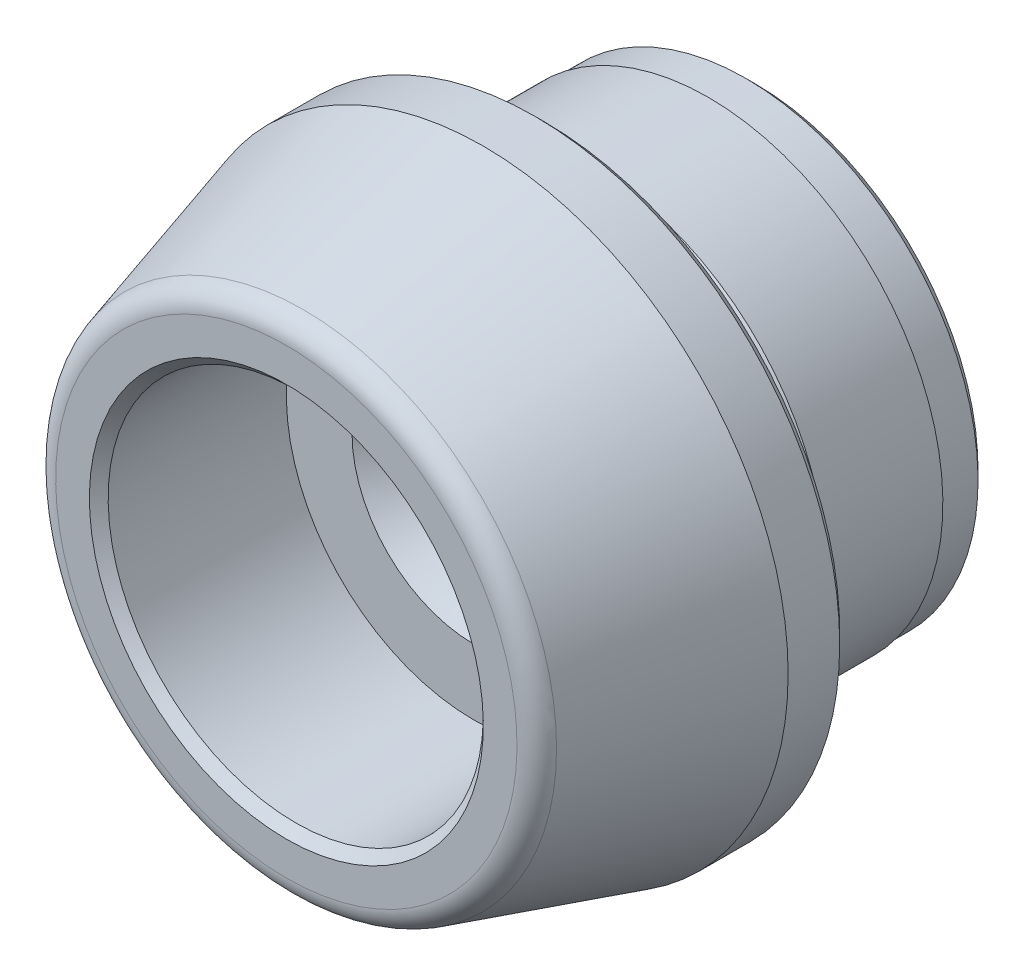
ISO-10303-21;
HEADER;
FILE_DESCRIPTION(('STEP AP214'),'2;1');
FILE_NAME('part.step','',(''),(''),'','','');
FILE_SCHEMA(('AUTOMOTIVE_DESIGN { 1 0 10303 214 1 1 1 1 }'));
ENDSEC;
DATA;
#1=APPLICATION_CONTEXT('core data for automotive mechanical design processes');
#2=APPLICATION_PROTOCOL_DEFINITION('international standard','automotive_design',2000,#1);
#3=PRODUCT_CONTEXT('',#1,'mechanical');
#4=PRODUCT('Part','Part','',(#3));
#5=PRODUCT_RELATED_PRODUCT_CATEGORY('part','',(#4));
#6=PRODUCT_DEFINITION_FORMATION('','',#4);
#7=PRODUCT_DEFINITION_CONTEXT('part definition',#1,'design');
#8=PRODUCT_DEFINITION('design','',#6,#7);
#9=PRODUCT_DEFINITION_SHAPE('','',#8);
#10=(LENGTH_UNIT() NAMED_UNIT(*) SI_UNIT(.MILLI.,.METRE.));
#11=(NAMED_UNIT(*) PLANE_ANGLE_UNIT() SI_UNIT($,.RADIAN.));
#12=(NAMED_UNIT(*) SI_UNIT($,.STERADIAN.) SOLID_ANGLE_UNIT());
#13=UNCERTAINTY_MEASURE_WITH_UNIT(LENGTH_MEASURE(1.E-05),#10,'distance_accuracy_value','');
#14=(GEOMETRIC_REPRESENTATION_CONTEXT(3) GLOBAL_UNCERTAINTY_ASSIGNED_CONTEXT((#13)) GLOBAL_UNIT_ASSIGNED_CONTEXT((#10,
#11,#12)) REPRESENTATION_CONTEXT('',''));
#15=CARTESIAN_POINT('',(0.,0.,0.));
#16=DIRECTION('',(0.,0.,1.));
#17=DIRECTION('',(1.,0.,0.));
#18=AXIS2_PLACEMENT_3D('',#15,#16,#17);
#19=CARTESIAN_POINT('',(0.,0.,10.));
#20=DIRECTION('',(0.,0.,1.));
#21=DIRECTION('',(0.,-1.,0.));
#22=AXIS2_PLACEMENT_3D('',#19,#20,#21);
#23=CYLINDRICAL_SURFACE('',#22,2.1);
#24=CARTESIAN_POINT('',(0.,0.,5.5));
#25=DIRECTION('',(0.,0.,1.));
#26=DIRECTION('',(0.,-1.,0.));
#27=AXIS2_PLACEMENT_3D('',#24,#25,#26);
#28=CIRCLE('',#27,2.1);
#29=CARTESIAN_POINT('',(0.,-2.10000000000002,5.49999999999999));
#30=VERTEX_POINT('',#29);
#31=EDGE_CURVE('E21',#30,#30,#28,.T.);
#32=ORIENTED_EDGE('',*,*,#31,.T.);
#33=EDGE_LOOP('',(#32));
#34=FACE_BOUND('',#33,.T.);
#35=CARTESIAN_POINT('',(0.,0.,0.500000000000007));
#36=DIRECTION('',(0.,0.,-1.));
#37=DIRECTION('',(0.,1.,0.));
#38=AXIS2_PLACEMENT_3D('',#35,#36,#37);
#39=CIRCLE('',#38,2.1);
#40=CARTESIAN_POINT('',(0.,2.1,0.500000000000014));
#41=VERTEX_POINT('',#40);
#42=EDGE_CURVE('E25',#41,#41,#39,.T.);
#43=ORIENTED_EDGE('',*,*,#42,.T.);
#44=EDGE_LOOP('',(#43));
#45=FACE_BOUND('',#44,.T.);
#46=ADVANCED_FACE('F14',(#34,#45),#23,.F.);
#47=CARTESIAN_POINT('',(0.,0.,0.));
#48=DIRECTION('',(0.,0.,-1.));
#49=DIRECTION('',(0.,1.,0.));
#50=AXIS2_PLACEMENT_3D('',#47,#48,#49);
#51=CYLINDRICAL_SURFACE('',#50,5.);
#52=CARTESIAN_POINT('',(0.,0.,3.5));
#53=DIRECTION('',(0.,0.,-1.));
#54=DIRECTION('',(0.,1.,0.));
#55=AXIS2_PLACEMENT_3D('',#52,#53,#54);
#56=CIRCLE('',#55,5.);
#57=CARTESIAN_POINT('',(0.,4.99999999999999,3.50000000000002));
#58=VERTEX_POINT('',#57);
#59=EDGE_CURVE('E76',#58,#58,#56,.T.);
#60=ORIENTED_EDGE('',*,*,#59,.T.);
#61=EDGE_LOOP('',(#60));
#62=FACE_BOUND('',#61,.T.);
#63=CARTESIAN_POINT('',(0.,0.,1.));
#64=DIRECTION('',(0.,0.,-1.));
#65=DIRECTION('',(0.,1.,0.));
#66=AXIS2_PLACEMENT_3D('',#63,#64,#65);
#67=CIRCLE('',#66,5.);
#68=CARTESIAN_POINT('',(0.,5.,1.00000000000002));
#69=VERTEX_POINT('',#68);
#70=EDGE_CURVE('E64',#69,#69,#67,.T.);
#71=ORIENTED_EDGE('',*,*,#70,.F.);
#72=EDGE_LOOP('',(#71));
#73=FACE_BOUND('',#72,.T.);
#74=ADVANCED_FACE('F123',(#62,#73),#51,.T.);
#75=CARTESIAN_POINT('',(0.,0.,0.));
#76=DIRECTION('',(0.,0.,-1.));
#77=DIRECTION('',(0.,1.,0.));
#78=AXIS2_PLACEMENT_3D('',#75,#76,#77);
#79=PLANE('',#78);
#80=CARTESIAN_POINT('',(0.,0.,0.));
#81=DIRECTION('',(0.,0.,-1.));
#82=DIRECTION('',(0.,1.,0.));
#83=AXIS2_PLACEMENT_3D('',#80,#81,#82);
#84=CIRCLE('',#83,2.6);
#85=CARTESIAN_POINT('',(0.,2.6,0.));
#86=VERTEX_POINT('',#85);
#87=EDGE_CURVE('E9',#86,#86,#84,.F.);
#88=ORIENTED_EDGE('',*,*,#87,.T.);
#89=EDGE_LOOP('',(#88));
#90=FACE_BOUND('',#89,.T.);
#91=CARTESIAN_POINT('',(0.,0.,0.));
#92=DIRECTION('',(0.,0.,-1.));
#93=DIRECTION('',(0.,1.,0.));
#94=AXIS2_PLACEMENT_3D('',#91,#92,#93);
#95=CIRCLE('',#94,4.75);
#96=CARTESIAN_POINT('',(0.,4.75,0.));
#97=VERTEX_POINT('',#96);
#98=EDGE_CURVE('E37',#97,#97,#95,.T.);
#99=ORIENTED_EDGE('',*,*,#98,.T.);
#100=EDGE_LOOP('',(#99));
#101=FACE_BOUND('',#100,.T.);
#102=ADVANCED_FACE('F129',(#90,#101),#79,.T.);
#103=CARTESIAN_POINT('',(0.,0.,10.));
#104=DIRECTION('',(0.,0.,1.));
#105=DIRECTION('',(0.,-1.,0.));
#106=AXIS2_PLACEMENT_3D('',#103,#104,#105);
#107=PLANE('',#106);
#108=CARTESIAN_POINT('',(0.,0.,10.));
#109=DIRECTION('',(0.,0.,1.));
#110=DIRECTION('',(0.,-1.,0.));
#111=AXIS2_PLACEMENT_3D('',#108,#109,#110);
#112=CIRCLE('',#111,4.2);
#113=CARTESIAN_POINT('',(0.,-4.20000000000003,9.99999999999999));
#114=VERTEX_POINT('',#113);
#115=EDGE_CURVE('E40',#114,#114,#112,.F.);
#116=ORIENTED_EDGE('',*,*,#115,.T.);
#117=EDGE_LOOP('',(#116));
#118=FACE_BOUND('',#117,.T.);
#119=CARTESIAN_POINT('',(0.,0.,10.));
#120=DIRECTION('',(0.,0.,1.));
#121=DIRECTION('',(0.,-1.,0.));
#122=AXIS2_PLACEMENT_3D('',#119,#120,#121);
#123=CIRCLE('',#122,4.91889235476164);
#124=CARTESIAN_POINT('',(0.,-4.91889235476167,9.99999999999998));
#125=VERTEX_POINT('',#124);
#126=EDGE_CURVE('E52',#125,#125,#123,.T.);
#127=ORIENTED_EDGE('',*,*,#126,.T.);
#128=EDGE_LOOP('',(#127));
#129=FACE_BOUND('',#128,.T.);
#130=ADVANCED_FACE('F137',(#118,#129),#107,.T.);
#131=CARTESIAN_POINT('',(0.,0.,5.8));
#132=DIRECTION('',(0.,0.,-1.));
#133=DIRECTION('',(0.,1.,0.));
#134=AXIS2_PLACEMENT_3D('',#131,#132,#133);
#135=CONICAL_SURFACE('',#134,6.5,0.279252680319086);
#136=CARTESIAN_POINT('',(0.,0.,9.63781867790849));
#137=DIRECTION('',(0.,0.,1.));
#138=DIRECTION('',(0.,-1.,0.));
#139=AXIS2_PLACEMENT_3D('',#136,#137,#138);
#140=CIRCLE('',#139,5.3995232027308);
#141=CARTESIAN_POINT('',(0.,-5.39952320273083,9.63781867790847));
#142=VERTEX_POINT('',#141);
#143=EDGE_CURVE('E55',#142,#142,#140,.F.);
#144=ORIENTED_EDGE('',*,*,#143,.T.);
#145=EDGE_LOOP('',(#144));
#146=FACE_BOUND('',#145,.T.);
#147=CARTESIAN_POINT('',(0.,0.,5.8));
#148=DIRECTION('',(0.,0.,-1.));
#149=DIRECTION('',(0.,1.,0.));
#150=AXIS2_PLACEMENT_3D('',#147,#148,#149);
#151=CIRCLE('',#150,6.5);
#152=CARTESIAN_POINT('',(0.,6.49999999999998,5.80000000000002));
#153=VERTEX_POINT('',#152);
#154=EDGE_CURVE('E58',#153,#153,#151,.T.);
#155=ORIENTED_EDGE('',*,*,#154,.F.);
#156=EDGE_LOOP('',(#155));
#157=FACE_BOUND('',#156,.T.);
#158=ADVANCED_FACE('F141',(#146,#157),#135,.T.);
#159=CARTESIAN_POINT('',(0.,0.,0.));
#160=DIRECTION('',(0.,0.,-1.));
#161=DIRECTION('',(0.,1.,0.));
#162=AXIS2_PLACEMENT_3D('',#159,#160,#161);
#163=CYLINDRICAL_SURFACE('',#162,6.5);
#164=CARTESIAN_POINT('',(0.,0.,4.7));
#165=DIRECTION('',(0.,0.,-1.));
#166=DIRECTION('',(0.,1.,0.));
#167=AXIS2_PLACEMENT_3D('',#164,#165,#166);
#168=CIRCLE('',#167,6.5);
#169=CARTESIAN_POINT('',(0.,6.49999999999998,4.70000000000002));
#170=VERTEX_POINT('',#169);
#171=EDGE_CURVE('E46',#170,#170,#168,.F.);
#172=ORIENTED_EDGE('',*,*,#171,.T.);
#173=EDGE_LOOP('',(#172));
#174=FACE_BOUND('',#173,.T.);
#175=ORIENTED_EDGE('',*,*,#154,.T.);
#176=EDGE_LOOP('',(#175));
#177=FACE_BOUND('',#176,.T.);
#178=ADVANCED_FACE('F100',(#174,#177),#163,.T.);
#179=CARTESIAN_POINT('',(6.5,0.,4.5));
#180=DIRECTION('',(0.,0.,-1.));
#181=DIRECTION('',(0.,1.,0.));
#182=AXIS2_PLACEMENT_3D('',#179,#180,#181);
#183=PLANE('',#182);
#184=CARTESIAN_POINT('',(0.,0.,4.5));
#185=DIRECTION('',(0.,0.,-1.));
#186=DIRECTION('',(0.,1.,0.));
#187=AXIS2_PLACEMENT_3D('',#184,#185,#186);
#188=CIRCLE('',#187,5.5);
#189=CARTESIAN_POINT('',(0.,5.49999999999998,4.50000000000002));
#190=VERTEX_POINT('',#189);
#191=EDGE_CURVE('E79',#190,#190,#188,.T.);
#192=ORIENTED_EDGE('',*,*,#191,.F.);
#193=EDGE_LOOP('',(#192));
#194=FACE_BOUND('',#193,.T.);
#195=CARTESIAN_POINT('',(0.,0.,4.5));
#196=DIRECTION('',(0.,0.,-1.));
#197=DIRECTION('',(0.,1.,0.));
#198=AXIS2_PLACEMENT_3D('',#195,#196,#197);
#199=CIRCLE('',#198,6.3);
#200=CARTESIAN_POINT('',(0.,6.29999999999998,4.50000000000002));
#201=VERTEX_POINT('',#200);
#202=EDGE_CURVE('E49',#201,#201,#199,.T.);
#203=ORIENTED_EDGE('',*,*,#202,.T.);
#204=EDGE_LOOP('',(#203));
#205=FACE_BOUND('',#204,.T.);
#206=ADVANCED_FACE('F96',(#194,#205),#183,.T.);
#207=CARTESIAN_POINT('',(0.,0.,0.));
#208=DIRECTION('',(0.,0.,-1.));
#209=DIRECTION('',(0.,1.,0.));
#210=AXIS2_PLACEMENT_3D('',#207,#208,#209);
#211=CYLINDRICAL_SURFACE('',#210,4.95);
#212=CARTESIAN_POINT('',(0.,0.,0.2));
#213=DIRECTION('',(0.,0.,-1.));
#214=DIRECTION('',(0.,1.,0.));
#215=AXIS2_PLACEMENT_3D('',#212,#213,#214);
#216=CIRCLE('',#215,4.95);
#217=CARTESIAN_POINT('',(0.,4.95,0.200000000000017));
#218=VERTEX_POINT('',#217);
#219=EDGE_CURVE('E34',#218,#218,#216,.F.);
#220=ORIENTED_EDGE('',*,*,#219,.T.);
#221=EDGE_LOOP('',(#220));
#222=FACE_BOUND('',#221,.T.);
#223=CARTESIAN_POINT('',(0.,0.,1.));
#224=DIRECTION('',(0.,0.,-1.));
#225=DIRECTION('',(0.,1.,0.));
#226=AXIS2_PLACEMENT_3D('',#223,#224,#225);
#227=CIRCLE('',#226,4.95);
#228=CARTESIAN_POINT('',(0.,4.95,1.00000000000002));
#229=VERTEX_POINT('',#228);
#230=EDGE_CURVE('E61',#229,#229,#227,.T.);
#231=ORIENTED_EDGE('',*,*,#230,.T.);
#232=EDGE_LOOP('',(#231));
#233=FACE_BOUND('',#232,.T.);
#234=ADVANCED_FACE('F99',(#222,#233),#211,.T.);
#235=CARTESIAN_POINT('',(-4.95,0.,1.));
#236=DIRECTION('',(0.,0.,-1.));
#237=DIRECTION('',(0.,1.,0.));
#238=AXIS2_PLACEMENT_3D('',#235,#236,#237);
#239=PLANE('',#238);
#240=ORIENTED_EDGE('',*,*,#70,.T.);
#241=EDGE_LOOP('',(#240));
#242=FACE_BOUND('',#241,.T.);
#243=ORIENTED_EDGE('',*,*,#230,.F.);
#244=EDGE_LOOP('',(#243));
#245=FACE_BOUND('',#244,.T.);
#246=ADVANCED_FACE('F169',(#242,#245),#239,.T.);
#247=CARTESIAN_POINT('',(0.,0.,6.));
#248=DIRECTION('',(0.,0.,1.));
#249=DIRECTION('',(0.,-1.,0.));
#250=AXIS2_PLACEMENT_3D('',#247,#248,#249);
#251=PLANE('',#250);
#252=CARTESIAN_POINT('',(0.,0.,6.));
#253=DIRECTION('',(0.,0.,1.));
#254=DIRECTION('',(0.,-1.,0.));
#255=AXIS2_PLACEMENT_3D('',#252,#253,#254);
#256=CIRCLE('',#255,2.6);
#257=CARTESIAN_POINT('',(0.,-2.60000000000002,5.99999999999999));
#258=VERTEX_POINT('',#257);
#259=EDGE_CURVE('E29',#258,#258,#256,.F.);
#260=ORIENTED_EDGE('',*,*,#259,.T.);
#261=EDGE_LOOP('',(#260));
#262=FACE_BOUND('',#261,.T.);
#263=CARTESIAN_POINT('',(0.,0.,6.));
#264=DIRECTION('',(0.,0.,1.));
#265=DIRECTION('',(0.,-1.,0.));
#266=AXIS2_PLACEMENT_3D('',#263,#264,#265);
#267=CIRCLE('',#266,4.);
#268=CARTESIAN_POINT('',(0.,-4.00000000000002,5.99999999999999));
#269=VERTEX_POINT('',#268);
#270=EDGE_CURVE('E67',#269,#269,#267,.T.);
#271=ORIENTED_EDGE('',*,*,#270,.T.);
#272=EDGE_LOOP('',(#271));
#273=FACE_BOUND('',#272,.T.);
#274=ADVANCED_FACE('F164',(#262,#273),#251,.T.);
#275=CARTESIAN_POINT('',(0.,0.,6.));
#276=DIRECTION('',(0.,0.,1.));
#277=DIRECTION('',(0.,-1.,0.));
#278=AXIS2_PLACEMENT_3D('',#275,#276,#277);
#279=CYLINDRICAL_SURFACE('',#278,4.);
#280=CARTESIAN_POINT('',(0.,0.,9.8));
#281=DIRECTION('',(0.,0.,1.));
#282=DIRECTION('',(0.,-1.,0.));
#283=AXIS2_PLACEMENT_3D('',#280,#281,#282);
#284=CIRCLE('',#283,4.);
#285=CARTESIAN_POINT('',(0.,-4.00000000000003,9.79999999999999));
#286=VERTEX_POINT('',#285);
#287=EDGE_CURVE('E43',#286,#286,#284,.T.);
#288=ORIENTED_EDGE('',*,*,#287,.T.);
#289=EDGE_LOOP('',(#288));
#290=FACE_BOUND('',#289,.T.);
#291=ORIENTED_EDGE('',*,*,#270,.F.);
#292=EDGE_LOOP('',(#291));
#293=FACE_BOUND('',#292,.T.);
#294=ADVANCED_FACE('F118',(#290,#293),#279,.F.);
#295=CARTESIAN_POINT('',(0.,0.,9.5));
#296=DIRECTION('',(0.,0.,1.));
#297=DIRECTION('',(0.,-1.,0.));
#298=AXIS2_PLACEMENT_3D('',#295,#296,#297);
#299=TOROIDAL_SURFACE('',#298,4.91889235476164,0.5);
#300=ORIENTED_EDGE('',*,*,#126,.F.);
#301=EDGE_LOOP('',(#300));
#302=FACE_BOUND('',#301,.T.);
#303=ORIENTED_EDGE('',*,*,#143,.F.);
#304=EDGE_LOOP('',(#303));
#305=FACE_BOUND('',#304,.T.);
#306=ADVANCED_FACE('F107',(#302,#305),#299,.T.);
#307=CARTESIAN_POINT('',(0.,0.,4.5));
#308=DIRECTION('',(0.,0.,1.));
#309=DIRECTION('',(0.,-1.,0.));
#310=AXIS2_PLACEMENT_3D('',#307,#308,#309);
#311=CONICAL_SURFACE('',#310,6.3,0.785398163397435);
#312=ORIENTED_EDGE('',*,*,#171,.F.);
#313=EDGE_LOOP('',(#312));
#314=FACE_BOUND('',#313,.T.);
#315=ORIENTED_EDGE('',*,*,#202,.F.);
#316=EDGE_LOOP('',(#315));
#317=FACE_BOUND('',#316,.T.);
#318=ADVANCED_FACE('F104',(#314,#317),#311,.T.);
#319=CARTESIAN_POINT('',(0.,0.,9.8));
#320=DIRECTION('',(0.,0.,1.));
#321=DIRECTION('',(0.,-1.,0.));
#322=AXIS2_PLACEMENT_3D('',#319,#320,#321);
#323=CONICAL_SURFACE('',#322,4.,0.785398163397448);
#324=ORIENTED_EDGE('',*,*,#115,.F.);
#325=EDGE_LOOP('',(#324));
#326=FACE_BOUND('',#325,.T.);
#327=ORIENTED_EDGE('',*,*,#287,.F.);
#328=EDGE_LOOP('',(#327));
#329=FACE_BOUND('',#328,.T.);
#330=ADVANCED_FACE('F106',(#326,#329),#323,.F.);
#331=CARTESIAN_POINT('',(0.,0.,4.4));
#332=DIRECTION('',(0.,0.,-1.));
#333=DIRECTION('',(0.,1.,0.));
#334=AXIS2_PLACEMENT_3D('',#331,#332,#333);
#335=TOROIDAL_SURFACE('',#334,5.1,0.4);
#336=CARTESIAN_POINT('',(0.,0.,4.4));
#337=DIRECTION('',(0.,0.,-1.));
#338=DIRECTION('',(0.,1.,0.));
#339=AXIS2_PLACEMENT_3D('',#336,#337,#338);
#340=CIRCLE('',#339,4.7);
#341=CARTESIAN_POINT('',(0.,4.69999999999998,4.40000000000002));
#342=VERTEX_POINT('',#341);
#343=EDGE_CURVE('E70',#342,#342,#340,.T.);
#344=ORIENTED_EDGE('',*,*,#343,.F.);
#345=EDGE_LOOP('',(#344));
#346=FACE_BOUND('',#345,.T.);
#347=CARTESIAN_POINT('',(0.,0.,4.58823529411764));
#348=DIRECTION('',(0.,0.,-1.));
#349=DIRECTION('',(0.,1.,0.));
#350=AXIS2_PLACEMENT_3D('',#347,#348,#349);
#351=CIRCLE('',#350,5.45294117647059);
#352=CARTESIAN_POINT('',(0.,5.45294117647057,4.58823529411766));
#353=VERTEX_POINT('',#352);
#354=EDGE_CURVE('E82',#353,#353,#351,.T.);
#355=ORIENTED_EDGE('',*,*,#354,.T.);
#356=EDGE_LOOP('',(#355));
#357=FACE_BOUND('',#356,.T.);
#358=ADVANCED_FACE('F86',(#346,#357),#335,.F.);
#359=CARTESIAN_POINT('',(0.,0.,0.));
#360=DIRECTION('',(0.,0.,-1.));
#361=DIRECTION('',(0.,1.,0.));
#362=AXIS2_PLACEMENT_3D('',#359,#360,#361);
#363=CYLINDRICAL_SURFACE('',#362,4.7);
#364=CARTESIAN_POINT('',(0.,0.,4.01961524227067));
#365=DIRECTION('',(0.,0.,-1.));
#366=DIRECTION('',(0.,1.,0.));
#367=AXIS2_PLACEMENT_3D('',#364,#365,#366);
#368=CIRCLE('',#367,4.7);
#369=CARTESIAN_POINT('',(0.,4.69999999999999,4.01961524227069));
#370=VERTEX_POINT('',#369);
#371=EDGE_CURVE('E73',#370,#370,#368,.T.);
#372=ORIENTED_EDGE('',*,*,#371,.F.);
#373=EDGE_LOOP('',(#372));
#374=FACE_BOUND('',#373,.T.);
#375=ORIENTED_EDGE('',*,*,#343,.T.);
#376=EDGE_LOOP('',(#375));
#377=FACE_BOUND('',#376,.T.);
#378=ADVANCED_FACE('F180',(#374,#377),#363,.T.);
#379=CARTESIAN_POINT('',(0.,0.,4.01961524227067));
#380=DIRECTION('',(0.,0.,-1.));
#381=DIRECTION('',(0.,1.,0.));
#382=AXIS2_PLACEMENT_3D('',#379,#380,#381);
#383=CONICAL_SURFACE('',#382,4.7,0.523598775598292);
#384=ORIENTED_EDGE('',*,*,#59,.F.);
#385=EDGE_LOOP('',(#384));
#386=FACE_BOUND('',#385,.T.);
#387=ORIENTED_EDGE('',*,*,#371,.T.);
#388=EDGE_LOOP('',(#387));
#389=FACE_BOUND('',#388,.T.);
#390=ADVANCED_FACE('F92',(#386,#389),#383,.T.);
#391=CARTESIAN_POINT('',(0.,0.,4.5));
#392=DIRECTION('',(0.,0.,-1.));
#393=DIRECTION('',(0.,1.,0.));
#394=AXIS2_PLACEMENT_3D('',#391,#392,#393);
#395=CONICAL_SURFACE('',#394,5.5,0.489957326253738);
#396=ORIENTED_EDGE('',*,*,#354,.F.);
#397=EDGE_LOOP('',(#396));
#398=FACE_BOUND('',#397,.T.);
#399=ORIENTED_EDGE('',*,*,#191,.T.);
#400=EDGE_LOOP('',(#399));
#401=FACE_BOUND('',#400,.T.);
#402=ADVANCED_FACE('F88',(#398,#401),#395,.F.);
#403=CARTESIAN_POINT('',(0.,0.,0.));
#404=DIRECTION('',(0.,0.,1.));
#405=DIRECTION('',(0.,-1.,0.));
#406=AXIS2_PLACEMENT_3D('',#403,#404,#405);
#407=CONICAL_SURFACE('',#406,4.75,0.785398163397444);
#408=ORIENTED_EDGE('',*,*,#219,.F.);
#409=EDGE_LOOP('',(#408));
#410=FACE_BOUND('',#409,.T.);
#411=ORIENTED_EDGE('',*,*,#98,.F.);
#412=EDGE_LOOP('',(#411));
#413=FACE_BOUND('',#412,.T.);
#414=ADVANCED_FACE('F91',(#410,#413),#407,.T.);
#415=CARTESIAN_POINT('',(0.,0.,6.));
#416=DIRECTION('',(0.,0.,1.));
#417=DIRECTION('',(0.,-1.,0.));
#418=AXIS2_PLACEMENT_3D('',#415,#416,#417);
#419=CONICAL_SURFACE('',#418,2.6,0.785398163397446);
#420=ORIENTED_EDGE('',*,*,#31,.F.);
#421=EDGE_LOOP('',(#420));
#422=FACE_BOUND('',#421,.T.);
#423=ORIENTED_EDGE('',*,*,#259,.F.);
#424=EDGE_LOOP('',(#423));
#425=FACE_BOUND('',#424,.T.);
#426=ADVANCED_FACE('F209',(#422,#425),#419,.F.);
#427=CARTESIAN_POINT('',(0.,0.,0.));
#428=DIRECTION('',(0.,0.,-1.));
#429=DIRECTION('',(0.,1.,0.));
#430=AXIS2_PLACEMENT_3D('',#427,#428,#429);
#431=CONICAL_SURFACE('',#430,2.6,0.785398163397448);
#432=ORIENTED_EDGE('',*,*,#42,.F.);
#433=EDGE_LOOP('',(#432));
#434=FACE_BOUND('',#433,.T.);
#435=ORIENTED_EDGE('',*,*,#87,.F.);
#436=EDGE_LOOP('',(#435));
#437=FACE_BOUND('',#436,.T.);
#438=ADVANCED_FACE('F16',(#434,#437),#431,.F.);
#439=CLOSED_SHELL('',(#46,#74,#102,#130,#158,#178,#206,#234,#246,#274,#294,#306,#318,#330,#358,
#378,#390,#402,#414,#426,#438));
#440=MANIFOLD_SOLID_BREP('B1',#439);
#441=ADVANCED_BREP_SHAPE_REPRESENTATION('',(#18,#440),#14);
#442=SHAPE_DEFINITION_REPRESENTATION(#9,#441);
ENDSEC;
END-ISO-10303-21;
